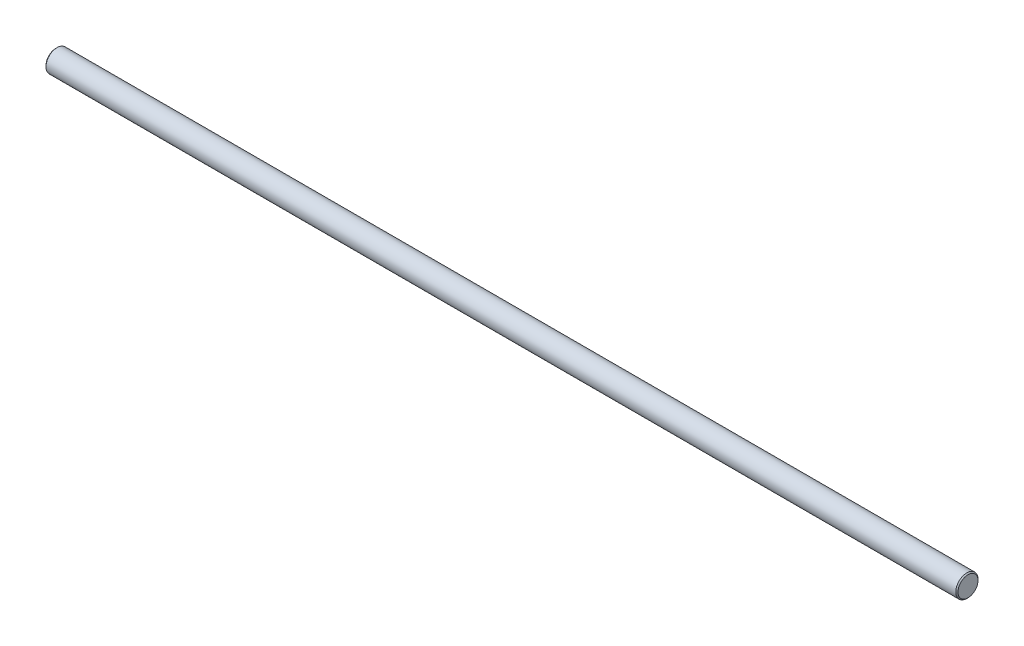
ISO-10303-21;
HEADER;
FILE_DESCRIPTION(('STEP AP214'),'2;1');
FILE_NAME('part.step','',(''),(''),'','','');
FILE_SCHEMA(('AUTOMOTIVE_DESIGN { 1 0 10303 214 1 1 1 1 }'));
ENDSEC;
DATA;
#1=APPLICATION_CONTEXT('core data for automotive mechanical design processes');
#2=APPLICATION_PROTOCOL_DEFINITION('international standard','automotive_design',2000,#1);
#3=PRODUCT_CONTEXT('',#1,'mechanical');
#4=PRODUCT('Part','Part','',(#3));
#5=PRODUCT_RELATED_PRODUCT_CATEGORY('part','',(#4));
#6=PRODUCT_DEFINITION_FORMATION('','',#4);
#7=PRODUCT_DEFINITION_CONTEXT('part definition',#1,'design');
#8=PRODUCT_DEFINITION('design','',#6,#7);
#9=PRODUCT_DEFINITION_SHAPE('','',#8);
#10=(LENGTH_UNIT() NAMED_UNIT(*) SI_UNIT(.MILLI.,.METRE.));
#11=(NAMED_UNIT(*) PLANE_ANGLE_UNIT() SI_UNIT($,.RADIAN.));
#12=(NAMED_UNIT(*) SI_UNIT($,.STERADIAN.) SOLID_ANGLE_UNIT());
#13=UNCERTAINTY_MEASURE_WITH_UNIT(LENGTH_MEASURE(1.E-05),#10,'distance_accuracy_value','');
#14=(GEOMETRIC_REPRESENTATION_CONTEXT(3) GLOBAL_UNCERTAINTY_ASSIGNED_CONTEXT((#13)) GLOBAL_UNIT_ASSIGNED_CONTEXT((#10,
#11,#12)) REPRESENTATION_CONTEXT('',''));
#15=CARTESIAN_POINT('',(0.,0.,0.));
#16=DIRECTION('',(0.,0.,1.));
#17=DIRECTION('',(1.,0.,0.));
#18=AXIS2_PLACEMENT_3D('',#15,#16,#17);
#19=CARTESIAN_POINT('',(0.,0.,0.));
#20=DIRECTION('',(1.,0.,0.));
#21=DIRECTION('',(0.,1.,0.));
#22=AXIS2_PLACEMENT_3D('',#19,#20,#21);
#23=PLANE('',#22);
#24=CARTESIAN_POINT('',(0.,0.,0.));
#25=DIRECTION('',(-1.,0.,0.));
#26=DIRECTION('',(0.,-1.,0.));
#27=AXIS2_PLACEMENT_3D('',#24,#25,#26);
#28=CIRCLE('',#27,4.5);
#29=CARTESIAN_POINT('',(0.,-4.5,0.));
#30=VERTEX_POINT('',#29);
#31=EDGE_CURVE('E10',#30,#30,#28,.T.);
#32=ORIENTED_EDGE('',*,*,#31,.T.);
#33=EDGE_LOOP('',(#32));
#34=FACE_BOUND('',#33,.T.);
#35=ADVANCED_FACE('F31',(#34),#23,.F.);
#36=CARTESIAN_POINT('',(0.5,0.,0.));
#37=DIRECTION('',(1.,0.,0.));
#38=DIRECTION('',(0.,1.,0.));
#39=AXIS2_PLACEMENT_3D('',#36,#37,#38);
#40=CONICAL_SURFACE('',#39,5.,0.785398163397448);
#41=ORIENTED_EDGE('',*,*,#31,.F.);
#42=EDGE_LOOP('',(#41));
#43=FACE_BOUND('',#42,.T.);
#44=CARTESIAN_POINT('',(0.5,0.,0.));
#45=DIRECTION('',(-1.,0.,0.));
#46=DIRECTION('',(0.,-1.,0.));
#47=AXIS2_PLACEMENT_3D('',#44,#45,#46);
#48=CIRCLE('',#47,5.);
#49=CARTESIAN_POINT('',(0.5,-5.,0.));
#50=VERTEX_POINT('',#49);
#51=EDGE_CURVE('E37',#50,#50,#48,.T.);
#52=ORIENTED_EDGE('',*,*,#51,.T.);
#53=EDGE_LOOP('',(#52));
#54=FACE_BOUND('',#53,.T.);
#55=ADVANCED_FACE('F63',(#43,#54),#40,.T.);
#56=CARTESIAN_POINT('',(410.,0.,0.));
#57=DIRECTION('',(-1.,0.,0.));
#58=DIRECTION('',(0.,-1.,0.));
#59=AXIS2_PLACEMENT_3D('',#56,#57,#58);
#60=CYLINDRICAL_SURFACE('',#59,4.99999999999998);
#61=ORIENTED_EDGE('',*,*,#51,.F.);
#62=EDGE_LOOP('',(#61));
#63=FACE_BOUND('',#62,.T.);
#64=CARTESIAN_POINT('',(409.5,0.,0.));
#65=DIRECTION('',(-1.,0.,0.));
#66=DIRECTION('',(0.,-1.,0.));
#67=AXIS2_PLACEMENT_3D('',#64,#65,#66);
#68=CIRCLE('',#67,4.99999999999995);
#69=CARTESIAN_POINT('',(409.5,-4.99999999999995,0.));
#70=VERTEX_POINT('',#69);
#71=EDGE_CURVE('E41',#70,#70,#68,.T.);
#72=ORIENTED_EDGE('',*,*,#71,.T.);
#73=EDGE_LOOP('',(#72));
#74=FACE_BOUND('',#73,.T.);
#75=ADVANCED_FACE('F59',(#63,#74),#60,.T.);
#76=CARTESIAN_POINT('',(410.,0.,0.));
#77=DIRECTION('',(-1.,0.,0.));
#78=DIRECTION('',(0.,-1.,0.));
#79=AXIS2_PLACEMENT_3D('',#76,#77,#78);
#80=CONICAL_SURFACE('',#79,4.5,0.785398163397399);
#81=ORIENTED_EDGE('',*,*,#71,.F.);
#82=EDGE_LOOP('',(#81));
#83=FACE_BOUND('',#82,.T.);
#84=CARTESIAN_POINT('',(410.,0.,0.));
#85=DIRECTION('',(-1.,0.,0.));
#86=DIRECTION('',(0.,-1.,0.));
#87=AXIS2_PLACEMENT_3D('',#84,#85,#86);
#88=CIRCLE('',#87,4.5);
#89=CARTESIAN_POINT('',(410.,-4.5,0.));
#90=VERTEX_POINT('',#89);
#91=EDGE_CURVE('E45',#90,#90,#88,.T.);
#92=ORIENTED_EDGE('',*,*,#91,.T.);
#93=EDGE_LOOP('',(#92));
#94=FACE_BOUND('',#93,.T.);
#95=ADVANCED_FACE('F51',(#83,#94),#80,.T.);
#96=CARTESIAN_POINT('',(410.,4.5,0.));
#97=DIRECTION('',(-1.,0.,0.));
#98=DIRECTION('',(0.,-1.,0.));
#99=AXIS2_PLACEMENT_3D('',#96,#97,#98);
#100=PLANE('',#99);
#101=ORIENTED_EDGE('',*,*,#91,.F.);
#102=EDGE_LOOP('',(#101));
#103=FACE_BOUND('',#102,.T.);
#104=ADVANCED_FACE('F53',(#103),#100,.F.);
#105=CLOSED_SHELL('',(#35,#55,#75,#95,#104));
#106=MANIFOLD_SOLID_BREP('B2',#105);
#107=ADVANCED_BREP_SHAPE_REPRESENTATION('',(#18,#106),#14);
#108=SHAPE_DEFINITION_REPRESENTATION(#9,#107);
ENDSEC;
END-ISO-10303-21;
